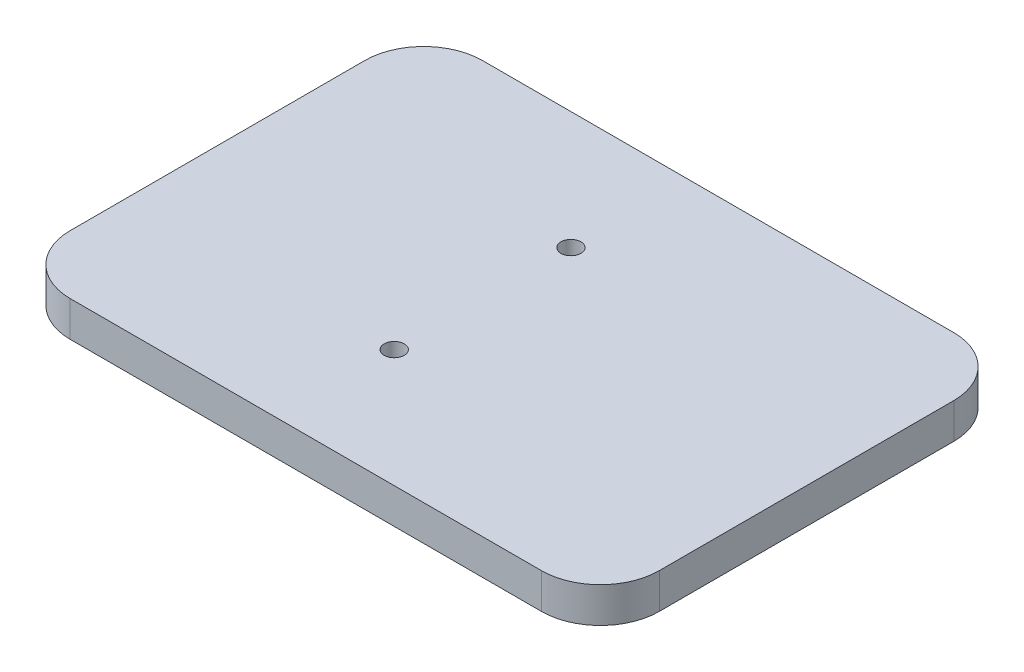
from build123d import *

# Parameters (mm, degrees)
SKETCH1_W                                           = 100
SKETCH1_H                                           = 70
EXTRUDE1_DEPTH                                      = 6
CBORE_FOR_M3_HEX_SOCKET_HEAD_CAP_SCREW1_D           = 3.4
CBORE_FOR_M3_HEX_SOCKET_HEAD_CAP_SCREW1_CBORE_D     = 6.5
CBORE_FOR_M3_HEX_SOCKET_HEAD_CAP_SCREW1_CBORE_DEPTH = 3
FILLET1_R                                           = 10


with BuildPart() as part:
    # Sketch1 → Extrude1 (new body)
    with BuildSketch(Plane(origin=(0, 0, 0), x_dir=(1, 0, 0), z_dir=(0, 1, 0))):
        with Locations((50, 35)):
            Rectangle(SKETCH1_W, SKETCH1_H)
    extrude(amount=EXTRUDE1_DEPTH)

    # CBORE for M3 Hex Socket Head Cap Screw1 (through all)
    with Locations(Plane(origin=(45, 0, -20), x_dir=(0, 0, -1), z_dir=(0, -1, 0))):
        with Locations((0, 0), (30, 0)):
            CounterBoreHole(CBORE_FOR_M3_HEX_SOCKET_HEAD_CAP_SCREW1_D / 2, CBORE_FOR_M3_HEX_SOCKET_HEAD_CAP_SCREW1_CBORE_D / 2, CBORE_FOR_M3_HEX_SOCKET_HEAD_CAP_SCREW1_CBORE_DEPTH)

    # Fillet1
    fillet1_edges = [part.edges().sort_by_distance(p)[0] for p in [
        (0, 3, -70),
        (100, 3, -70),
        (100, 3, 0),
        (0, 3, 0),
    ]]
    fillet(fillet1_edges, radius=FILLET1_R)


solid = part.part
